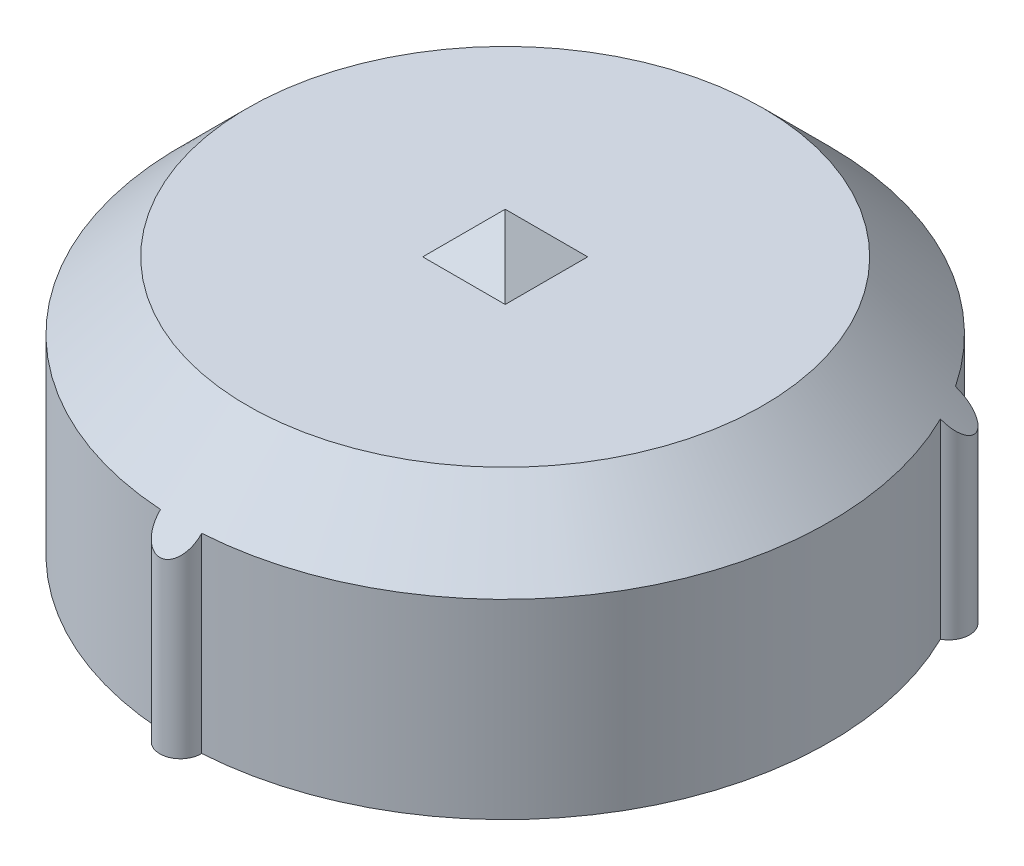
ISO-10303-21;
HEADER;
FILE_DESCRIPTION(('STEP AP214'),'2;1');
FILE_NAME('part.step','',(''),(''),'','','');
FILE_SCHEMA(('AUTOMOTIVE_DESIGN { 1 0 10303 214 1 1 1 1 }'));
ENDSEC;
DATA;
#1=APPLICATION_CONTEXT('core data for automotive mechanical design processes');
#2=APPLICATION_PROTOCOL_DEFINITION('international standard','automotive_design',2000,#1);
#3=PRODUCT_CONTEXT('',#1,'mechanical');
#4=PRODUCT('Part','Part','',(#3));
#5=PRODUCT_RELATED_PRODUCT_CATEGORY('part','',(#4));
#6=PRODUCT_DEFINITION_FORMATION('','',#4);
#7=PRODUCT_DEFINITION_CONTEXT('part definition',#1,'design');
#8=PRODUCT_DEFINITION('design','',#6,#7);
#9=PRODUCT_DEFINITION_SHAPE('','',#8);
#10=(LENGTH_UNIT() NAMED_UNIT(*) SI_UNIT(.MILLI.,.METRE.));
#11=(NAMED_UNIT(*) PLANE_ANGLE_UNIT() SI_UNIT($,.RADIAN.));
#12=(NAMED_UNIT(*) SI_UNIT($,.STERADIAN.) SOLID_ANGLE_UNIT());
#13=UNCERTAINTY_MEASURE_WITH_UNIT(LENGTH_MEASURE(1.E-05),#10,'distance_accuracy_value','');
#14=(GEOMETRIC_REPRESENTATION_CONTEXT(3) GLOBAL_UNCERTAINTY_ASSIGNED_CONTEXT((#13)) GLOBAL_UNIT_ASSIGNED_CONTEXT((#10,
#11,#12)) REPRESENTATION_CONTEXT('',''));
#15=CARTESIAN_POINT('',(0.,0.,0.));
#16=DIRECTION('',(0.,0.,1.));
#17=DIRECTION('',(1.,0.,0.));
#18=AXIS2_PLACEMENT_3D('',#15,#16,#17);
#19=CARTESIAN_POINT('',(6.7,5.,0.));
#20=DIRECTION('',(0.,-1.,0.));
#21=DIRECTION('',(0.,0.,-1.));
#22=AXIS2_PLACEMENT_3D('',#19,#20,#21);
#23=PLANE('',#22);
#24=DIRECTION('',(0.,0.,-1.));
#25=VECTOR('',#24,1.);
#26=CARTESIAN_POINT('',(0.8,5.,0.));
#27=LINE('',#26,#25);
#28=CARTESIAN_POINT('',(0.8,5.,0.799999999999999));
#29=VERTEX_POINT('',#28);
#30=CARTESIAN_POINT('',(0.8,5.,-0.800000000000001));
#31=VERTEX_POINT('',#30);
#32=EDGE_CURVE('E111',#29,#31,#27,.T.);
#33=ORIENTED_EDGE('',*,*,#32,.F.);
#34=DIRECTION('',(1.,0.,0.));
#35=VECTOR('',#34,1.);
#36=CARTESIAN_POINT('',(6.7,5.,0.799999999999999));
#37=LINE('',#36,#35);
#38=CARTESIAN_POINT('',(-0.799999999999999,5.,0.799999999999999));
#39=VERTEX_POINT('',#38);
#40=EDGE_CURVE('E107',#39,#29,#37,.T.);
#41=ORIENTED_EDGE('',*,*,#40,.F.);
#42=DIRECTION('',(0.,0.,1.));
#43=VECTOR('',#42,1.);
#44=CARTESIAN_POINT('',(-0.799999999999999,5.,0.));
#45=LINE('',#44,#43);
#46=CARTESIAN_POINT('',(-0.8,5.,-0.800000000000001));
#47=VERTEX_POINT('',#46);
#48=EDGE_CURVE('E110',#47,#39,#45,.T.);
#49=ORIENTED_EDGE('',*,*,#48,.F.);
#50=DIRECTION('',(-1.,0.,0.));
#51=VECTOR('',#50,1.);
#52=CARTESIAN_POINT('',(6.7,5.,-0.800000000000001));
#53=LINE('',#52,#51);
#54=EDGE_CURVE('E61',#31,#47,#53,.T.);
#55=ORIENTED_EDGE('',*,*,#54,.F.);
#56=EDGE_LOOP('',(#33,#41,#49,#55));
#57=FACE_BOUND('',#56,.T.);
#58=CARTESIAN_POINT('',(0.,5.,0.));
#59=DIRECTION('',(0.,-1.,0.));
#60=DIRECTION('',(0.,0.,-1.));
#61=AXIS2_PLACEMENT_3D('',#58,#59,#60);
#62=CIRCLE('',#61,5.);
#63=CARTESIAN_POINT('',(0.,5.,-5.));
#64=VERTEX_POINT('',#63);
#65=EDGE_CURVE('E249',#64,#64,#62,.T.);
#66=ORIENTED_EDGE('',*,*,#65,.F.);
#67=EDGE_LOOP('',(#66));
#68=FACE_BOUND('',#67,.T.);
#69=ADVANCED_FACE('F37',(#57,#68),#23,.F.);
#70=CARTESIAN_POINT('',(0.8,5.,0.));
#71=DIRECTION('',(0.707106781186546,0.707106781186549,0.));
#72=DIRECTION('',(-0.707106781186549,0.707106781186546,0.));
#73=AXIS2_PLACEMENT_3D('',#70,#71,#72);
#74=PLANE('',#73);
#75=DIRECTION('',(0.577350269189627,-0.577350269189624,0.577350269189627));
#76=VECTOR('',#75,1.);
#77=CARTESIAN_POINT('',(0.533333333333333,5.26666666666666,0.533333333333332));
#78=LINE('',#77,#76);
#79=CARTESIAN_POINT('',(0.,5.8,0.));
#80=VERTEX_POINT('',#79);
#81=EDGE_CURVE('E74',#80,#29,#78,.T.);
#82=ORIENTED_EDGE('',*,*,#81,.T.);
#83=ORIENTED_EDGE('',*,*,#32,.T.);
#84=DIRECTION('',(0.577350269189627,-0.577350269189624,-0.577350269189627));
#85=VECTOR('',#84,1.);
#86=CARTESIAN_POINT('',(2.76666666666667,3.03333333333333,-2.76666666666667));
#87=LINE('',#86,#85);
#88=EDGE_CURVE('E113',#80,#31,#87,.T.);
#89=ORIENTED_EDGE('',*,*,#88,.F.);
#90=EDGE_LOOP('',(#82,#83,#89));
#91=FACE_BOUND('',#90,.T.);
#92=ADVANCED_FACE('F141',(#91),#74,.T.);
#93=CARTESIAN_POINT('',(6.7,5.,-0.800000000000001));
#94=DIRECTION('',(0.,0.707106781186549,-0.707106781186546));
#95=DIRECTION('',(0.,0.707106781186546,0.707106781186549));
#96=AXIS2_PLACEMENT_3D('',#93,#94,#95);
#97=PLANE('',#96);
#98=ORIENTED_EDGE('',*,*,#88,.T.);
#99=ORIENTED_EDGE('',*,*,#54,.T.);
#100=DIRECTION('',(-0.577350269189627,-0.577350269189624,-0.577350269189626));
#101=VECTOR('',#100,1.);
#102=CARTESIAN_POINT('',(-0.533333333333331,5.26666666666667,-0.533333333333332));
#103=LINE('',#102,#101);
#104=EDGE_CURVE('E121',#80,#47,#103,.T.);
#105=ORIENTED_EDGE('',*,*,#104,.F.);
#106=EDGE_LOOP('',(#98,#99,#105));
#107=FACE_BOUND('',#106,.T.);
#108=ADVANCED_FACE('F139',(#107),#97,.T.);
#109=CARTESIAN_POINT('',(-0.799999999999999,5.,0.));
#110=DIRECTION('',(-0.707106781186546,0.707106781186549,0.));
#111=DIRECTION('',(-0.707106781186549,-0.707106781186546,0.));
#112=AXIS2_PLACEMENT_3D('',#109,#110,#111);
#113=PLANE('',#112);
#114=ORIENTED_EDGE('',*,*,#104,.T.);
#115=ORIENTED_EDGE('',*,*,#48,.T.);
#116=DIRECTION('',(-0.577350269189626,-0.577350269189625,0.577350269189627));
#117=VECTOR('',#116,1.);
#118=CARTESIAN_POINT('',(1.7,7.5,-1.70000000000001));
#119=LINE('',#118,#117);
#120=EDGE_CURVE('E119',#80,#39,#119,.T.);
#121=ORIENTED_EDGE('',*,*,#120,.F.);
#122=EDGE_LOOP('',(#114,#115,#121));
#123=FACE_BOUND('',#122,.T.);
#124=ADVANCED_FACE('F118',(#123),#113,.T.);
#125=CARTESIAN_POINT('',(6.7,5.,0.799999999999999));
#126=DIRECTION('',(0.,0.707106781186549,0.707106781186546));
#127=DIRECTION('',(0.,-0.707106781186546,0.707106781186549));
#128=AXIS2_PLACEMENT_3D('',#125,#126,#127);
#129=PLANE('',#128);
#130=ORIENTED_EDGE('',*,*,#120,.T.);
#131=ORIENTED_EDGE('',*,*,#40,.T.);
#132=ORIENTED_EDGE('',*,*,#81,.F.);
#133=EDGE_LOOP('',(#130,#131,#132));
#134=FACE_BOUND('',#133,.T.);
#135=ADVANCED_FACE('F39',(#134),#129,.T.);
#136=CARTESIAN_POINT('',(0.,1.,0.));
#137=DIRECTION('',(0.,-1.,0.));
#138=DIRECTION('',(0.,0.,-1.));
#139=AXIS2_PLACEMENT_3D('',#136,#137,#138);
#140=CONICAL_SURFACE('',#139,9.00000000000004,0.785398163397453);
#141=ORIENTED_EDGE('',*,*,#65,.T.);
#142=EDGE_LOOP('',(#141));
#143=FACE_BOUND('',#142,.T.);
#144=CARTESIAN_POINT('',(-0.399791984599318,3.70020000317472,6.28710158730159));
#145=CARTESIAN_POINT('',(-0.400276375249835,3.68501121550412,6.30228975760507));
#146=CARTESIAN_POINT('',(-0.399906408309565,3.66984579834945,6.31750988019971));
#147=CARTESIAN_POINT('',(-0.397410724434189,3.63961971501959,6.34795303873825));
#148=CARTESIAN_POINT('',(-0.39528246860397,3.62455923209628,6.36317604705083));
#149=CARTESIAN_POINT('',(-0.386139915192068,3.5794362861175,6.40894719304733));
#150=CARTESIAN_POINT('',(-0.376357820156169,3.54969158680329,6.43933811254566));
#151=CARTESIAN_POINT('',(-0.352934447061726,3.500780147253,6.48963860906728));
#152=CARTESIAN_POINT('',(-0.341294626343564,3.48108995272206,6.50998631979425));
#153=CARTESIAN_POINT('',(-0.313802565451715,3.44330777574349,6.54919521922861));
#154=CARTESIAN_POINT('',(-0.297965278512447,3.42521041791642,6.56806138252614));
#155=CARTESIAN_POINT('',(-0.26624140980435,3.39551381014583,6.59913280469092));
#156=CARTESIAN_POINT('',(-0.251318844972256,3.3834092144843,6.61183711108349));
#157=CARTESIAN_POINT('',(-0.218868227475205,3.36100571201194,6.63540636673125));
#158=CARTESIAN_POINT('',(-0.20134289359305,3.35070494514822,6.64627321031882));
#159=CARTESIAN_POINT('',(-0.167491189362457,3.33427189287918,6.66364103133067));
#160=CARTESIAN_POINT('',(-0.151595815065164,3.32771848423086,6.67058010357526));
#161=CARTESIAN_POINT('',(-0.118441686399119,3.31650434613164,6.68246687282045));
#162=CARTESIAN_POINT('',(-0.101183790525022,3.31184243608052,6.68741581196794));
#163=CARTESIAN_POINT('',(-0.0655994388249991,3.30469683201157,6.6950056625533));
#164=CARTESIAN_POINT('',(-0.0472667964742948,3.30222741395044,6.69763144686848));
#165=CARTESIAN_POINT('',(-0.0102507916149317,3.29971947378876,6.70029820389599));
#166=CARTESIAN_POINT('',(0.00843240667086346,3.29967984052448,6.70034035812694));
#167=CARTESIAN_POINT('',(0.0434913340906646,3.30190417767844,6.69797514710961));
#168=CARTESIAN_POINT('',(0.0599015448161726,3.30392415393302,6.69582723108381));
#169=CARTESIAN_POINT('',(0.0920168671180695,3.30977071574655,6.68961582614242));
#170=CARTESIAN_POINT('',(0.10772190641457,3.31359748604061,6.68555214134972));
#171=CARTESIAN_POINT('',(0.138576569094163,3.32299046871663,6.67558998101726));
#172=CARTESIAN_POINT('',(0.153692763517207,3.32860801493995,6.66963738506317));
#173=CARTESIAN_POINT('',(0.182603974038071,3.3412673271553,6.65624449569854));
#174=CARTESIAN_POINT('',(0.196398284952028,3.34830984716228,6.64880341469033));
#175=CARTESIAN_POINT('',(0.228953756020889,3.36728782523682,6.62878912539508));
#176=CARTESIAN_POINT('',(0.246853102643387,3.37993376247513,6.6154836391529));
#177=CARTESIAN_POINT('',(0.279464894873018,3.40709355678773,6.58700235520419));
#178=CARTESIAN_POINT('',(0.294170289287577,3.42161143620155,6.57182253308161));
#179=CARTESIAN_POINT('',(0.325248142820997,3.4574252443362,6.53451278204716));
#180=CARTESIAN_POINT('',(0.340323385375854,3.47928323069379,6.51184435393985));
#181=CARTESIAN_POINT('',(0.36526303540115,3.52452392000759,6.46518059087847));
#182=CARTESIAN_POINT('',(0.375116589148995,3.54790968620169,6.44118260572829));
#183=CARTESIAN_POINT('',(0.389099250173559,3.59275509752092,6.39542430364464));
#184=CARTESIAN_POINT('',(0.393762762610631,3.61412045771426,6.3737302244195));
#185=CARTESIAN_POINT('',(0.399436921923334,3.6570531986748,6.33035787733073));
#186=CARTESIAN_POINT('',(0.400472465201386,3.6786181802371,6.30868052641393));
#187=CARTESIAN_POINT('',(0.399791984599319,3.70020000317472,6.28710158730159));
#188=B_SPLINE_CURVE_WITH_KNOTS('',3,(#144,#145,#146,#147,#148,#149,#150,#151,#152,#153,#154,
#155,#156,#157,#158,#159,#160,#161,#162,#163,#164,#165,#166,#167,#168,#169,#170,#171,#172,#173,
#174,#175,#176,#177,#178,#179,#180,#181,#182,#183,#184,#185,#186,#187),.UNSPECIFIED.,.F.,.F.,(4,
2,2,2,2,2,2,2,2,2,2,2,2,2,2,2,2,2,2,2,2,4),(0.,0.06440994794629,0.128913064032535,
0.259007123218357,0.350565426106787,0.441801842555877,0.510670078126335,0.579466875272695,
0.634867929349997,0.690234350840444,0.745958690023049,0.801657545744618,0.851446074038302,
0.901239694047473,0.952613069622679,1.00401370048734,1.08050149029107,1.15715646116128,
1.26133441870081,1.36572807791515,1.45792201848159,1.54948203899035),.UNSPECIFIED.);
#189=CARTESIAN_POINT('',(-0.399798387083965,3.70000000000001,6.28730158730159));
#190=VERTEX_POINT('',#189);
#191=CARTESIAN_POINT('',(0.399798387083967,3.70000000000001,6.28730158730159));
#192=VERTEX_POINT('',#191);
#193=EDGE_CURVE('E131',#190,#192,#188,.T.);
#194=ORIENTED_EDGE('',*,*,#193,.T.);
#195=CARTESIAN_POINT('',(0.,3.70000000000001,0.));
#196=DIRECTION('',(0.,-1.,0.));
#197=DIRECTION('',(0.,0.,-1.));
#198=AXIS2_PLACEMENT_3D('',#195,#196,#197);
#199=CIRCLE('',#198,6.3);
#200=CARTESIAN_POINT('',(5.64486208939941,3.70000000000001,-2.79741523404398));
#201=VERTEX_POINT('',#200);
#202=EDGE_CURVE('E213',#192,#201,#199,.F.);
#203=ORIENTED_EDGE('',*,*,#202,.T.);
#204=CARTESIAN_POINT('',(5.6126935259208,3.73567462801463,-2.78198557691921));
#205=CARTESIAN_POINT('',(5.62350822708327,3.72393671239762,-2.78659567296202));
#206=CARTESIAN_POINT('',(5.63411507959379,3.71217820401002,-2.79167418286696));
#207=CARTESIAN_POINT('',(5.67141489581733,3.66991170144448,-2.81159855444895));
#208=CARTESIAN_POINT('',(5.69676735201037,3.63942675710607,-2.82909849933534));
#209=CARTESIAN_POINT('',(5.74344452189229,3.57934365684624,-2.87014548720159));
#210=CARTESIAN_POINT('',(5.76476542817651,3.54974636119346,-2.89369819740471));
#211=CARTESIAN_POINT('',(5.79654338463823,3.50096671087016,-2.93898496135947));
#212=CARTESIAN_POINT('',(5.80835252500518,3.48127639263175,-2.95922521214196));
#213=CARTESIAN_POINT('',(5.82859484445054,3.44346546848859,-3.00263953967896));
#214=CARTESIAN_POINT('',(5.8370347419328,3.42534179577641,-3.0258076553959));
#215=CARTESIAN_POINT('',(5.84810630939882,3.39561143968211,-3.06884364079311));
#216=CARTESIAN_POINT('',(5.85165566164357,3.38349778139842,-3.08812324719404));
#217=CARTESIAN_POINT('',(5.85585698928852,3.36107877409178,-3.12801689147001));
#218=CARTESIAN_POINT('',(5.85651255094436,3.35077120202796,-3.14862924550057));
#219=CARTESIAN_POINT('',(5.85464049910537,3.33432545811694,-3.18663389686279));
#220=CARTESIAN_POINT('',(5.85270784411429,3.32776624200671,-3.20387168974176));
#221=CARTESIAN_POINT('',(5.84643567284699,3.31654039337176,-3.2385336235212));
#222=CARTESIAN_POINT('',(5.84209764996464,3.3118725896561,-3.25595764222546));
#223=CARTESIAN_POINT('',(5.83088750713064,3.30471546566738,-3.29057829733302));
#224=CARTESIAN_POINT('',(5.82399918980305,3.30224042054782,-3.30777273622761));
#225=CARTESIAN_POINT('',(5.80780708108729,3.29972200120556,-3.34117408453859));
#226=CARTESIAN_POINT('',(5.79850436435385,3.2996775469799,-3.35738142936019));
#227=CARTESIAN_POINT('',(5.77893088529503,3.30189378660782,-3.38657048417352));
#228=CARTESIAN_POINT('',(5.76886799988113,3.30391005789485,-3.39971195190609));
#229=CARTESIAN_POINT('',(5.74743502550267,3.30974978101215,-3.42442664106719));
#230=CARTESIAN_POINT('',(5.73606481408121,3.31357340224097,-3.43599971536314));
#231=CARTESIAN_POINT('',(5.71201419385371,3.32295992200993,-3.45774591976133));
#232=CARTESIAN_POINT('',(5.69930375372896,3.32857392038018,-3.46786331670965));
#233=CARTESIAN_POINT('',(5.67325485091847,3.34122624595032,-3.48621019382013));
#234=CARTESIAN_POINT('',(5.65991607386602,3.34826529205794,-3.49443871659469));
#235=CARTESIAN_POINT('',(5.6263164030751,3.36723198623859,-3.5126299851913));
#236=CARTESIAN_POINT('',(5.60585215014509,3.37986958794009,-3.52148143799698));
#237=CARTESIAN_POINT('',(5.56489096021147,3.40701597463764,-3.53549323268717));
#238=CARTESIAN_POINT('',(5.54439406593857,3.4215292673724,-3.54064447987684));
#239=CARTESIAN_POINT('',(5.49652702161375,3.45734841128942,-3.54892100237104));
#240=CARTESIAN_POINT('',(5.46933935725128,3.47921844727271,-3.55064899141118));
#241=CARTESIAN_POINT('',(5.41646828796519,3.52444533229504,-3.54892473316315));
#242=CARTESIAN_POINT('',(5.39078537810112,3.54780266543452,-3.54547079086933));
#243=CARTESIAN_POINT('',(5.34424226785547,3.59256650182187,-3.5347331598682));
#244=CARTESIAN_POINT('',(5.32317074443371,3.61387755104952,-3.527950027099));
#245=CARTESIAN_POINT('',(5.28270360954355,3.65685932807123,-3.51119543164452));
#246=CARTESIAN_POINT('',(5.26330946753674,3.67853035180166,-3.50122120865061));
#247=CARTESIAN_POINT('',(5.2184874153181,3.73127201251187,-3.47337647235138));
#248=CARTESIAN_POINT('',(5.19405029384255,3.7623780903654,-3.45395474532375));
#249=CARTESIAN_POINT('',(5.1498916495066,3.82379226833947,-3.40942863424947));
#250=CARTESIAN_POINT('',(5.13015808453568,3.85410222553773,-3.38433908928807));
#251=CARTESIAN_POINT('',(5.10891681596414,3.89120419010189,-3.34908422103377));
#252=CARTESIAN_POINT('',(5.10466357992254,3.89892738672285,-3.34148303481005));
#253=CARTESIAN_POINT('',(5.1006312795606,3.90656758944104,-3.3336885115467));
#254=B_SPLINE_CURVE_WITH_KNOTS('',3,(#204,#205,#206,#207,#208,#209,#210,#211,#212,#213,#214,
#215,#216,#217,#218,#219,#220,#221,#222,#223,#224,#225,#226,#227,#228,#229,#230,#231,#232,#233,
#234,#235,#236,#237,#238,#239,#240,#241,#242,#243,#244,#245,#246,#247,#248,#249,#250,#251,#252,
#253),.UNSPECIFIED.,.F.,.F.,(4,2,2,2,2,2,2,2,2,2,2,2,2,2,2,2,2,2,2,2,2,2,2,2,4),(0.,
0.0498545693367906,0.179265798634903,0.308798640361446,0.40032767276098,0.491673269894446,
0.560569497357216,0.629380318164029,0.684792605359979,0.740170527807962,0.795906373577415,
0.851617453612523,0.901409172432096,0.951205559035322,1.00257407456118,1.05396856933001,
1.13042741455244,1.20707355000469,1.31131676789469,1.4155940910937,1.50755427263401,
1.59959421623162,1.731205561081,1.86247624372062,1.8973860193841),.UNSPECIFIED.);
#255=CARTESIAN_POINT('',(5.24506370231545,3.70000000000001,-3.4898863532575));
#256=VERTEX_POINT('',#255);
#257=EDGE_CURVE('E52',#201,#256,#254,.T.);
#258=ORIENTED_EDGE('',*,*,#257,.T.);
#259=CARTESIAN_POINT('',(0.,3.70000000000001,0.));
#260=DIRECTION('',(0.,-1.,0.));
#261=DIRECTION('',(0.,0.,-1.));
#262=AXIS2_PLACEMENT_3D('',#259,#260,#261);
#263=CIRCLE('',#262,6.3);
#264=CARTESIAN_POINT('',(-5.2450637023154,3.70000000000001,-3.48988635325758));
#265=VERTEX_POINT('',#264);
#266=EDGE_CURVE('E11',#256,#265,#263,.F.);
#267=ORIENTED_EDGE('',*,*,#266,.T.);
#268=CARTESIAN_POINT('',(-5.10063127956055,3.90656758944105,-3.33368851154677));
#269=CARTESIAN_POINT('',(-5.11238638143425,3.88432274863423,-3.35635110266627));
#270=CARTESIAN_POINT('',(-5.12595984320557,3.86143069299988,-3.37736718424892));
#271=CARTESIAN_POINT('',(-5.15618050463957,3.81494226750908,-3.41596580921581));
#272=CARTESIAN_POINT('',(-5.17281752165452,3.79134844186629,-3.43355934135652));
#273=CARTESIAN_POINT('',(-5.20051646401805,3.75470266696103,-3.45808723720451));
#274=CARTESIAN_POINT('',(-5.21066580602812,3.74174435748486,-3.46622643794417));
#275=CARTESIAN_POINT('',(-5.22888007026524,3.71926499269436,-3.47943180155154));
#276=CARTESIAN_POINT('',(-5.23677862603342,3.70974931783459,-3.48473847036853));
#277=CARTESIAN_POINT('',(-5.27077678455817,3.66974238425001,-3.50586339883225));
#278=CARTESIAN_POINT('',(-5.29860587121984,3.63926648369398,-3.51905790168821));
#279=CARTESIAN_POINT('',(-5.35749594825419,3.57919194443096,-3.53893749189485));
#280=CARTESIAN_POINT('',(-5.38856163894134,3.5495946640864,-3.54561296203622));
#281=CARTESIAN_POINT('',(-5.44367378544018,3.50082478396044,-3.55046588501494));
#282=CARTESIAN_POINT('',(-5.4671020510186,3.48114352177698,-3.55056339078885));
#283=CARTESIAN_POINT('',(-5.51480734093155,3.44335321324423,-3.54636916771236));
#284=CARTESIAN_POINT('',(-5.53908247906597,3.42524095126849,-3.54208665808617));
#285=CARTESIAN_POINT('',(-5.58187417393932,3.39552836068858,-3.53014543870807));
#286=CARTESIAN_POINT('',(-5.60034047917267,3.38342133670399,-3.52357450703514));
#287=CARTESIAN_POINT('',(-5.63697938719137,3.36101559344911,-3.50725720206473));
#288=CARTESIAN_POINT('',(-5.65515232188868,3.35071467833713,-3.49751472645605));
#289=CARTESIAN_POINT('',(-5.68711933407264,3.33428035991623,-3.47688450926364));
#290=CARTESIAN_POINT('',(-5.70107719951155,3.32772603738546,-3.46658883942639));
#291=CARTESIAN_POINT('',(-5.72795020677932,3.31651004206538,-3.44382087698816));
#292=CARTESIAN_POINT('',(-5.74086599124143,3.31184719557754,-3.43134994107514));
#293=CARTESIAN_POINT('',(-5.76523302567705,3.3046997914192,-3.40432851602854));
#294=CARTESIAN_POINT('',(-5.77667428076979,3.30222949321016,-3.38976511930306));
#295=CARTESIAN_POINT('',(-5.79749381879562,3.29971987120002,-3.35904171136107));
#296=CARTESIAN_POINT('',(-5.80687301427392,3.29967946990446,-3.34288241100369));
#297=CARTESIAN_POINT('',(-5.82235589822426,3.30190254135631,-3.31133753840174));
#298=CARTESIAN_POINT('',(-5.82870157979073,3.30392194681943,-3.2960518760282));
#299=CARTESIAN_POINT('',(-5.83938135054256,3.3097674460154,-3.26513341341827));
#300=CARTESIAN_POINT('',(-5.84371525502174,3.31359370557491,-3.2495005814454));
#301=CARTESIAN_POINT('',(-5.85051629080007,3.32298565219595,-3.21779870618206));
#302=CARTESIAN_POINT('',(-5.85291987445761,3.32860264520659,-3.20173154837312));
#303=CARTESIAN_POINT('',(-5.85577805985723,3.3412608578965,-3.16999755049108));
#304=CARTESIAN_POINT('',(-5.85623163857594,3.34830282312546,-3.15433092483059));
#305=CARTESIAN_POINT('',(-5.85517800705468,3.36727840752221,-3.11613229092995));
#306=CARTESIAN_POINT('',(-5.85260607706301,3.37992228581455,-3.09398031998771));
#307=CARTESIAN_POINT('',(-5.84424896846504,3.40707976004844,-3.05149744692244));
#308=CARTESIAN_POINT('',(-5.83845630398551,3.42159765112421,-3.03117091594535));
#309=CARTESIAN_POINT('',(-5.82168047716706,3.45742188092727,-2.98558608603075));
#310=CARTESIAN_POINT('',(-5.80957975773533,3.47929159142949,-2.96118388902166));
#311=CARTESIAN_POINT('',(-5.78163693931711,3.52453139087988,-2.91625709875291));
#312=CARTESIAN_POINT('',(-5.76579130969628,3.54790288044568,-2.89573619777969));
#313=CARTESIAN_POINT('',(-5.7331765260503,3.59271765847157,-2.86077145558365));
#314=CARTESIAN_POINT('',(-5.71673237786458,3.61406658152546,-2.84589749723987));
#315=CARTESIAN_POINT('',(-5.68195347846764,3.65707861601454,-2.8192331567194));
#316=CARTESIAN_POINT('',(-5.66362176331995,3.67874117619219,-2.80743792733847));
#317=CARTESIAN_POINT('',(-5.63411740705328,3.71217630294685,-2.79167422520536));
#318=CARTESIAN_POINT('',(-5.62351095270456,3.72393476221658,-2.78659522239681));
#319=CARTESIAN_POINT('',(-5.61269352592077,3.73567462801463,-2.78198557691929));
#320=B_SPLINE_CURVE_WITH_KNOTS('',3,(#268,#269,#270,#271,#272,#273,#274,#275,#276,#277,#278,
#279,#280,#281,#282,#283,#284,#285,#286,#287,#288,#289,#290,#291,#292,#293,#294,#295,#296,#297,
#298,#299,#300,#301,#302,#303,#304,#305,#306,#307,#308,#309,#310,#311,#312,#313,#314,#315,#316,
#317,#318,#319),.UNSPECIFIED.,.F.,.F.,(4,2,2,2,2,2,2,2,2,2,2,2,2,2,2,2,2,2,2,2,2,2,2,2,2,4),(0.,
0.101433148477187,0.202535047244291,0.257583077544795,0.297943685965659,0.427301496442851,
0.556849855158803,0.648349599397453,0.739657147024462,0.808535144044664,0.877328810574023,
0.932731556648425,0.988099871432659,1.04382569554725,1.09952680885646,1.14931606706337,
1.19910989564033,1.25048255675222,1.30188216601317,1.37836131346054,1.45501896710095,
1.5592514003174,1.66358249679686,1.75570589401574,1.84768336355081,1.8975379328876),.UNSPECIFIED.);
#321=CARTESIAN_POINT('',(-5.64486208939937,3.70000000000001,-2.79741523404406));
#322=VERTEX_POINT('',#321);
#323=EDGE_CURVE('E219',#265,#322,#320,.T.);
#324=ORIENTED_EDGE('',*,*,#323,.T.);
#325=CARTESIAN_POINT('',(0.,3.70000000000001,0.));
#326=DIRECTION('',(0.,-1.,0.));
#327=DIRECTION('',(0.,0.,-1.));
#328=AXIS2_PLACEMENT_3D('',#325,#326,#327);
#329=CIRCLE('',#328,6.3);
#330=EDGE_CURVE('E84',#322,#190,#329,.F.);
#331=ORIENTED_EDGE('',*,*,#330,.T.);
#332=EDGE_LOOP('',(#194,#203,#258,#267,#324,#331));
#333=FACE_BOUND('',#332,.T.);
#334=ADVANCED_FACE('F236',(#143,#333),#140,.T.);
#335=CARTESIAN_POINT('',(0.,0.,0.));
#336=DIRECTION('',(0.,1.,0.));
#337=DIRECTION('',(0.,0.,1.));
#338=AXIS2_PLACEMENT_3D('',#335,#336,#337);
#339=PLANE('',#338);
#340=CARTESIAN_POINT('',(0.,0.,0.));
#341=DIRECTION('',(0.,1.,0.));
#342=DIRECTION('',(0.,0.,1.));
#343=AXIS2_PLACEMENT_3D('',#340,#341,#342);
#344=CIRCLE('',#343,6.3);
#345=CARTESIAN_POINT('',(0.399798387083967,0.,6.28730158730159));
#346=VERTEX_POINT('',#345);
#347=CARTESIAN_POINT('',(5.64486208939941,0.,-2.79741523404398));
#348=VERTEX_POINT('',#347);
#349=EDGE_CURVE('E156',#346,#348,#344,.T.);
#350=ORIENTED_EDGE('',*,*,#349,.F.);
#351=CARTESIAN_POINT('',(0.,0.,6.3));
#352=DIRECTION('',(0.,1.,0.));
#353=DIRECTION('',(0.,0.,1.));
#354=AXIS2_PLACEMENT_3D('',#351,#352,#353);
#355=CIRCLE('',#354,0.4);
#356=CARTESIAN_POINT('',(-0.399798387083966,0.,6.28730158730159));
#357=VERTEX_POINT('',#356);
#358=EDGE_CURVE('E148',#357,#346,#355,.T.);
#359=ORIENTED_EDGE('',*,*,#358,.F.);
#360=CARTESIAN_POINT('',(0.,0.,0.));
#361=DIRECTION('',(0.,1.,0.));
#362=DIRECTION('',(0.,0.,1.));
#363=AXIS2_PLACEMENT_3D('',#360,#361,#362);
#364=CIRCLE('',#363,6.3);
#365=CARTESIAN_POINT('',(-5.64486208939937,0.,-2.79741523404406));
#366=VERTEX_POINT('',#365);
#367=EDGE_CURVE('E143',#366,#357,#364,.T.);
#368=ORIENTED_EDGE('',*,*,#367,.F.);
#369=CARTESIAN_POINT('',(-5.45596004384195,0.,-3.15000000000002));
#370=DIRECTION('',(0.,1.,0.));
#371=DIRECTION('',(0.,0.,1.));
#372=AXIS2_PLACEMENT_3D('',#369,#370,#371);
#373=CIRCLE('',#372,0.4);
#374=CARTESIAN_POINT('',(-5.2450637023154,0.,-3.48988635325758));
#375=VERTEX_POINT('',#374);
#376=EDGE_CURVE('E166',#375,#366,#373,.T.);
#377=ORIENTED_EDGE('',*,*,#376,.F.);
#378=CARTESIAN_POINT('',(0.,0.,0.));
#379=DIRECTION('',(0.,1.,0.));
#380=DIRECTION('',(0.,0.,1.));
#381=AXIS2_PLACEMENT_3D('',#378,#379,#380);
#382=CIRCLE('',#381,6.3);
#383=CARTESIAN_POINT('',(5.24506370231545,0.,-3.4898863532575));
#384=VERTEX_POINT('',#383);
#385=EDGE_CURVE('E162',#384,#375,#382,.T.);
#386=ORIENTED_EDGE('',*,*,#385,.F.);
#387=CARTESIAN_POINT('',(5.45596004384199,0.,-3.14999999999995));
#388=DIRECTION('',(0.,1.,0.));
#389=DIRECTION('',(0.,0.,1.));
#390=AXIS2_PLACEMENT_3D('',#387,#388,#389);
#391=CIRCLE('',#390,0.4);
#392=EDGE_CURVE('E159',#348,#384,#391,.T.);
#393=ORIENTED_EDGE('',*,*,#392,.F.);
#394=EDGE_LOOP('',(#350,#359,#368,#377,#386,#393));
#395=FACE_BOUND('',#394,.T.);
#396=ADVANCED_FACE('F192',(#395),#339,.F.);
#397=CARTESIAN_POINT('',(0.,5.,0.));
#398=DIRECTION('',(0.,-1.,0.));
#399=DIRECTION('',(0.,0.,-1.));
#400=AXIS2_PLACEMENT_3D('',#397,#398,#399);
#401=CYLINDRICAL_SURFACE('',#400,6.3);
#402=ORIENTED_EDGE('',*,*,#330,.F.);
#403=DIRECTION('',(0.,-1.,0.));
#404=VECTOR('',#403,1.);
#405=CARTESIAN_POINT('',(-5.64486208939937,5.,-2.79741523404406));
#406=LINE('',#405,#404);
#407=EDGE_CURVE('E169',#322,#366,#406,.T.);
#408=ORIENTED_EDGE('',*,*,#407,.T.);
#409=ORIENTED_EDGE('',*,*,#367,.T.);
#410=DIRECTION('',(0.,-1.,0.));
#411=VECTOR('',#410,1.);
#412=CARTESIAN_POINT('',(-0.399798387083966,5.,6.28730158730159));
#413=LINE('',#412,#411);
#414=EDGE_CURVE('E46',#190,#357,#413,.T.);
#415=ORIENTED_EDGE('',*,*,#414,.F.);
#416=EDGE_LOOP('',(#402,#408,#409,#415));
#417=FACE_BOUND('',#416,.T.);
#418=ADVANCED_FACE('F195',(#417),#401,.T.);
#419=CARTESIAN_POINT('',(0.,5.,0.));
#420=DIRECTION('',(0.,-1.,0.));
#421=DIRECTION('',(0.,0.,-1.));
#422=AXIS2_PLACEMENT_3D('',#419,#420,#421);
#423=CYLINDRICAL_SURFACE('',#422,6.3);
#424=ORIENTED_EDGE('',*,*,#266,.F.);
#425=DIRECTION('',(0.,-1.,0.));
#426=VECTOR('',#425,1.);
#427=CARTESIAN_POINT('',(5.24506370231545,5.,-3.4898863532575));
#428=LINE('',#427,#426);
#429=EDGE_CURVE('E175',#256,#384,#428,.T.);
#430=ORIENTED_EDGE('',*,*,#429,.T.);
#431=ORIENTED_EDGE('',*,*,#385,.T.);
#432=DIRECTION('',(0.,-1.,0.));
#433=VECTOR('',#432,1.);
#434=CARTESIAN_POINT('',(-5.2450637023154,5.,-3.48988635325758));
#435=LINE('',#434,#433);
#436=EDGE_CURVE('E172',#265,#375,#435,.T.);
#437=ORIENTED_EDGE('',*,*,#436,.F.);
#438=EDGE_LOOP('',(#424,#430,#431,#437));
#439=FACE_BOUND('',#438,.T.);
#440=ADVANCED_FACE('F204',(#439),#423,.T.);
#441=CARTESIAN_POINT('',(-5.45596004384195,5.,-3.15000000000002));
#442=DIRECTION('',(0.,-1.,0.));
#443=DIRECTION('',(0.,0.,-1.));
#444=AXIS2_PLACEMENT_3D('',#441,#442,#443);
#445=CYLINDRICAL_SURFACE('',#444,0.4);
#446=ORIENTED_EDGE('',*,*,#323,.F.);
#447=ORIENTED_EDGE('',*,*,#436,.T.);
#448=ORIENTED_EDGE('',*,*,#376,.T.);
#449=ORIENTED_EDGE('',*,*,#407,.F.);
#450=EDGE_LOOP('',(#446,#447,#448,#449));
#451=FACE_BOUND('',#450,.T.);
#452=ADVANCED_FACE('F200',(#451),#445,.T.);
#453=CARTESIAN_POINT('',(0.,5.,0.));
#454=DIRECTION('',(0.,-1.,0.));
#455=DIRECTION('',(0.,0.,-1.));
#456=AXIS2_PLACEMENT_3D('',#453,#454,#455);
#457=CYLINDRICAL_SURFACE('',#456,6.3);
#458=ORIENTED_EDGE('',*,*,#202,.F.);
#459=DIRECTION('',(0.,-1.,0.));
#460=VECTOR('',#459,1.);
#461=CARTESIAN_POINT('',(0.399798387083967,5.,6.28730158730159));
#462=LINE('',#461,#460);
#463=EDGE_CURVE('E180',#192,#346,#462,.T.);
#464=ORIENTED_EDGE('',*,*,#463,.T.);
#465=ORIENTED_EDGE('',*,*,#349,.T.);
#466=DIRECTION('',(0.,-1.,0.));
#467=VECTOR('',#466,1.);
#468=CARTESIAN_POINT('',(5.64486208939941,5.,-2.79741523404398));
#469=LINE('',#468,#467);
#470=EDGE_CURVE('E177',#201,#348,#469,.T.);
#471=ORIENTED_EDGE('',*,*,#470,.F.);
#472=EDGE_LOOP('',(#458,#464,#465,#471));
#473=FACE_BOUND('',#472,.T.);
#474=ADVANCED_FACE('F212',(#473),#457,.T.);
#475=CARTESIAN_POINT('',(5.45596004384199,5.,-3.14999999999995));
#476=DIRECTION('',(0.,-1.,0.));
#477=DIRECTION('',(0.,0.,-1.));
#478=AXIS2_PLACEMENT_3D('',#475,#476,#477);
#479=CYLINDRICAL_SURFACE('',#478,0.4);
#480=ORIENTED_EDGE('',*,*,#257,.F.);
#481=ORIENTED_EDGE('',*,*,#470,.T.);
#482=ORIENTED_EDGE('',*,*,#392,.T.);
#483=ORIENTED_EDGE('',*,*,#429,.F.);
#484=EDGE_LOOP('',(#480,#481,#482,#483));
#485=FACE_BOUND('',#484,.T.);
#486=ADVANCED_FACE('F208',(#485),#479,.T.);
#487=CARTESIAN_POINT('',(0.,5.,6.3));
#488=DIRECTION('',(0.,-1.,0.));
#489=DIRECTION('',(0.,0.,-1.));
#490=AXIS2_PLACEMENT_3D('',#487,#488,#489);
#491=CYLINDRICAL_SURFACE('',#490,0.4);
#492=ORIENTED_EDGE('',*,*,#193,.F.);
#493=ORIENTED_EDGE('',*,*,#414,.T.);
#494=ORIENTED_EDGE('',*,*,#358,.T.);
#495=ORIENTED_EDGE('',*,*,#463,.F.);
#496=EDGE_LOOP('',(#492,#493,#494,#495));
#497=FACE_BOUND('',#496,.T.);
#498=ADVANCED_FACE('F186',(#497),#491,.T.);
#499=CLOSED_SHELL('',(#69,#92,#108,#124,#135,#334,#396,#418,#440,#452,#474,#486,#498));
#500=MANIFOLD_SOLID_BREP('B2',#499);
#501=ADVANCED_BREP_SHAPE_REPRESENTATION('',(#18,#500),#14);
#502=SHAPE_DEFINITION_REPRESENTATION(#9,#501);
ENDSEC;
END-ISO-10303-21;
